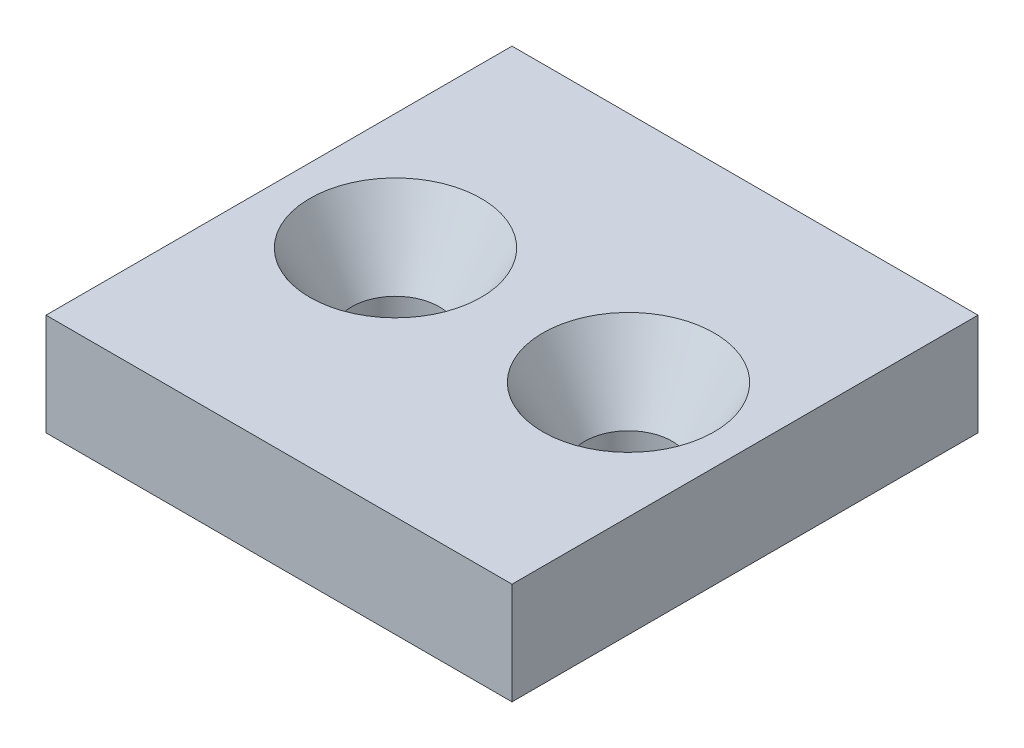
from build123d import *

# Parameters (mm, degrees)
SKETCH1_W                                      = 32
SKETCH1_H                                      = 32
BOSS_EXTRUDE1_DEPTH                            = 7
CSK_FOR_M6_FLAT_HEAD_MACHINE_SCREW1_AT_2_COUNT = 2
CSK_FOR_M6_FLAT_HEAD_MACHINE_SCREW1_AT_2_PITCH = 16


with BuildPart() as part:
    # Sketch1 → Boss-Extrude1 (new body)
    with BuildSketch(Plane(origin=(0, 0, 0), x_dir=(1, 0, 0), z_dir=(0, 1, 0))):
        Rectangle(SKETCH1_W, SKETCH1_H)
    extrude(amount=BOSS_EXTRUDE1_DEPTH)

    # Sketch2 → CSK for M6 Flat Head Machine Screw1 (revolve, cut)
    with BuildSketch(Plane(origin=(-8, 7, 0), x_dir=(0, 0, 1), z_dir=(1, 0, 0))):
        Polygon((0, 0), (0, 7), (3, 7), (3, 4.99696658), (5.885, 0), align=None)
    csk_for_m6_flat_head_machine_screw1 = revolve(axis=Axis((-8, 13.35, 0), (0, -1, 0)), mode=Mode.SUBTRACT)

    # CSK for M6 Flat Head Machine Screw1 at 2: CSK for M6 Flat Head Machine Screw1 ×2
    with Locations(*[(i * CSK_FOR_M6_FLAT_HEAD_MACHINE_SCREW1_AT_2_PITCH, 0, 0) for i in range(1, CSK_FOR_M6_FLAT_HEAD_MACHINE_SCREW1_AT_2_COUNT)]):
        add(csk_for_m6_flat_head_machine_screw1, mode=Mode.SUBTRACT)


solid = part.part
